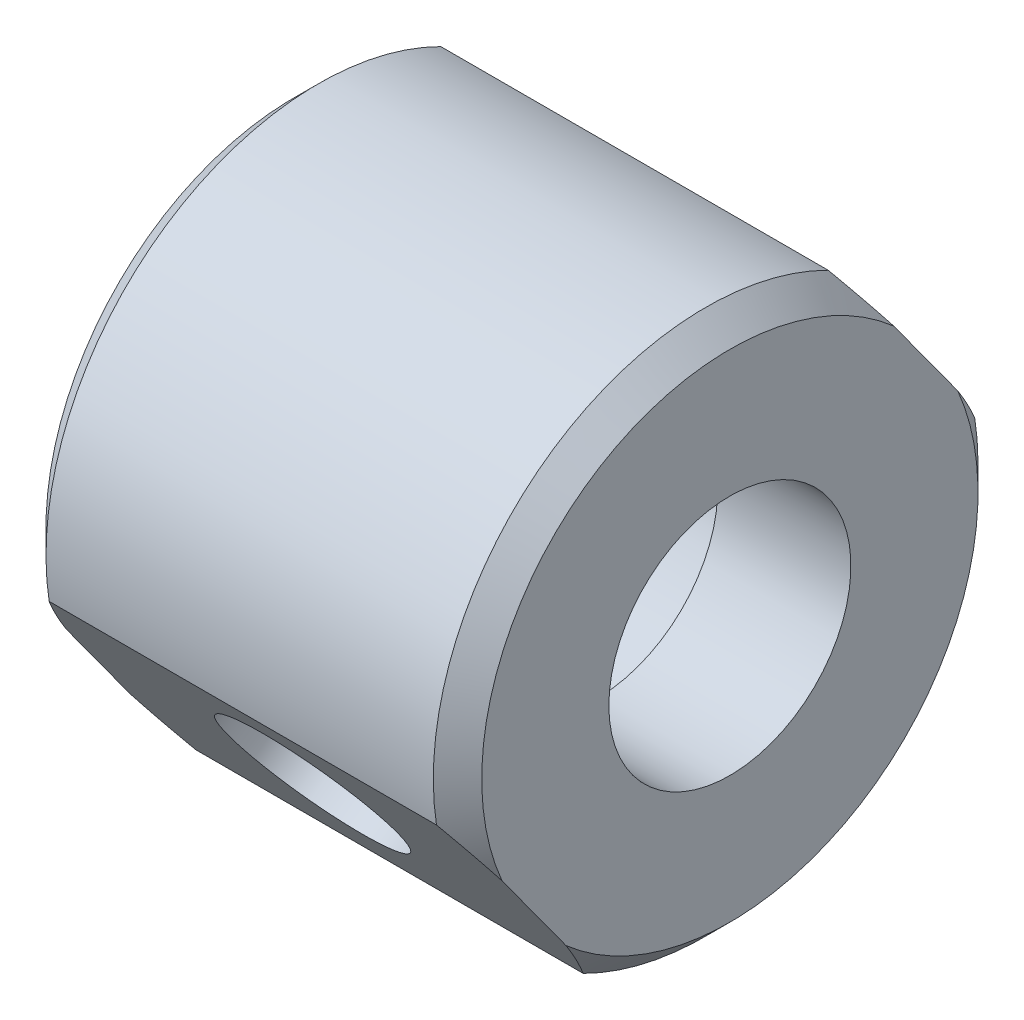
ISO-10303-21;
HEADER;
FILE_DESCRIPTION(('STEP AP214'),'2;1');
FILE_NAME('part.step','',(''),(''),'','','');
FILE_SCHEMA(('AUTOMOTIVE_DESIGN { 1 0 10303 214 1 1 1 1 }'));
ENDSEC;
DATA;
#1=APPLICATION_CONTEXT('core data for automotive mechanical design processes');
#2=APPLICATION_PROTOCOL_DEFINITION('international standard','automotive_design',2000,#1);
#3=PRODUCT_CONTEXT('',#1,'mechanical');
#4=PRODUCT('Part','Part','',(#3));
#5=PRODUCT_RELATED_PRODUCT_CATEGORY('part','',(#4));
#6=PRODUCT_DEFINITION_FORMATION('','',#4);
#7=PRODUCT_DEFINITION_CONTEXT('part definition',#1,'design');
#8=PRODUCT_DEFINITION('design','',#6,#7);
#9=PRODUCT_DEFINITION_SHAPE('','',#8);
#10=(LENGTH_UNIT() NAMED_UNIT(*) SI_UNIT(.MILLI.,.METRE.));
#11=(NAMED_UNIT(*) PLANE_ANGLE_UNIT() SI_UNIT($,.RADIAN.));
#12=(NAMED_UNIT(*) SI_UNIT($,.STERADIAN.) SOLID_ANGLE_UNIT());
#13=UNCERTAINTY_MEASURE_WITH_UNIT(LENGTH_MEASURE(1.E-05),#10,'distance_accuracy_value','');
#14=(GEOMETRIC_REPRESENTATION_CONTEXT(3) GLOBAL_UNCERTAINTY_ASSIGNED_CONTEXT((#13)) GLOBAL_UNIT_ASSIGNED_CONTEXT((#10,
#11,#12)) REPRESENTATION_CONTEXT('',''));
#15=CARTESIAN_POINT('',(0.,0.,0.));
#16=DIRECTION('',(0.,0.,1.));
#17=DIRECTION('',(1.,0.,0.));
#18=AXIS2_PLACEMENT_3D('',#15,#16,#17);
#19=CARTESIAN_POINT('',(-22.125,-21.375,0.));
#20=DIRECTION('',(-1.,0.,0.));
#21=DIRECTION('',(0.,0.,1.));
#22=AXIS2_PLACEMENT_3D('',#19,#20,#21);
#23=CYLINDRICAL_SURFACE('',#22,9.9999999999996);
#24=CARTESIAN_POINT('',(-33.125,-21.375,0.));
#25=DIRECTION('',(-1.,0.,0.));
#26=DIRECTION('',(0.,0.,1.));
#27=AXIS2_PLACEMENT_3D('',#24,#25,#26);
#28=CIRCLE('',#27,9.9999999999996);
#29=CARTESIAN_POINT('',(-33.125,-21.375,9.9999999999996));
#30=VERTEX_POINT('',#29);
#31=EDGE_CURVE('E213',#30,#30,#28,.F.);
#32=ORIENTED_EDGE('',*,*,#31,.F.);
#33=EDGE_LOOP('',(#32));
#34=FACE_BOUND('',#33,.T.);
#35=CARTESIAN_POINT('',(-22.125,-21.375,0.));
#36=DIRECTION('',(-1.,0.,0.));
#37=DIRECTION('',(0.,0.,1.));
#38=AXIS2_PLACEMENT_3D('',#35,#36,#37);
#39=CIRCLE('',#38,9.9999999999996);
#40=CARTESIAN_POINT('',(-22.125,-21.375,9.9999999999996));
#41=VERTEX_POINT('',#40);
#42=EDGE_CURVE('E214',#41,#41,#39,.T.);
#43=ORIENTED_EDGE('',*,*,#42,.F.);
#44=EDGE_LOOP('',(#43));
#45=FACE_BOUND('',#44,.T.);
#46=ADVANCED_FACE('F15',(#34,#45),#23,.F.);
#47=CARTESIAN_POINT('',(-22.125,-21.375,0.));
#48=DIRECTION('',(-1.,0.,0.));
#49=DIRECTION('',(0.,0.,1.));
#50=AXIS2_PLACEMENT_3D('',#47,#48,#49);
#51=CONICAL_SURFACE('',#50,20.5000000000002,0.785398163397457);
#52=CARTESIAN_POINT('',(-22.125,-21.375,0.));
#53=DIRECTION('',(-1.,0.,0.));
#54=DIRECTION('',(0.,0.,1.));
#55=AXIS2_PLACEMENT_3D('',#52,#53,#54);
#56=CIRCLE('',#55,20.5000000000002);
#57=CARTESIAN_POINT('',(-22.125,-36.7712815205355,13.5353062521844));
#58=VERTEX_POINT('',#57);
#59=CARTESIAN_POINT('',(-22.1249999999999,-13.2598714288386,-18.8253735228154));
#60=VERTEX_POINT('',#59);
#61=EDGE_CURVE('E82',#58,#60,#56,.F.);
#62=ORIENTED_EDGE('',*,*,#61,.F.);
#63=CARTESIAN_POINT('',(-22.1250000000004,-36.771281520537,13.5353062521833));
#64=CARTESIAN_POINT('',(-22.1676350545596,-36.9284200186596,13.4211384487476));
#65=CARTESIAN_POINT('',(-22.2127785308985,-37.0851070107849,13.3072986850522));
#66=CARTESIAN_POINT('',(-22.2993269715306,-37.3694720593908,13.1006953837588));
#67=CARTESIAN_POINT('',(-22.3399474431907,-37.497306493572,13.0078182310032));
#68=CARTESIAN_POINT('',(-22.4244049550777,-37.7526230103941,12.8223199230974));
#69=CARTESIAN_POINT('',(-22.468249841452,-37.8801033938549,12.7297000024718));
#70=CARTESIAN_POINT('',(-22.5507874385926,-38.1115046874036,12.5615771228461));
#71=CARTESIAN_POINT('',(-22.5889891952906,-38.2155406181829,12.4859905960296));
#72=CARTESIAN_POINT('',(-22.6862113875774,-38.4731207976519,12.2988476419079));
#73=CARTESIAN_POINT('',(-22.7463975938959,-38.6263781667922,12.1874996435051));
#74=CARTESIAN_POINT('',(-22.8596764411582,-38.9044390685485,11.9854765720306));
#75=CARTESIAN_POINT('',(-22.9121073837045,-39.0294197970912,11.8946727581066));
#76=CARTESIAN_POINT('',(-23.0197350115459,-39.2790023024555,11.7133404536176));
#77=CARTESIAN_POINT('',(-23.0749392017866,-39.4036019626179,11.6228135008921));
#78=CARTESIAN_POINT('',(-23.1777127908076,-39.6297431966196,11.4585122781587));
#79=CARTESIAN_POINT('',(-23.2248727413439,-39.7314069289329,11.3846492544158));
#80=CARTESIAN_POINT('',(-23.3516165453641,-39.9993514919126,11.1899761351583));
#81=CARTESIAN_POINT('',(-23.4325761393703,-40.1652078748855,11.0694744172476));
#82=CARTESIAN_POINT('',(-23.5837437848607,-40.4660355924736,10.8509102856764));
#83=CARTESIAN_POINT('',(-23.6532859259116,-40.6012267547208,10.7526881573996));
#84=CARTESIAN_POINT('',(-23.7952125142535,-40.8711500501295,10.5565774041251));
#85=CARTESIAN_POINT('',(-23.8676054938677,-41.0058792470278,10.4586909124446));
#86=CARTESIAN_POINT('',(-24.0016703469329,-41.2503613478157,10.2810642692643));
#87=CARTESIAN_POINT('',(-24.0629364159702,-41.3602599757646,10.2012182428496));
#88=CARTESIAN_POINT('',(-24.1250000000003,-41.4698613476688,10.1215881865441));
#89=B_SPLINE_CURVE_WITH_KNOTS('',3,(#63,#64,#65,#66,#67,#68,#69,#70,#71,#72,#73,#74,#75,#76,#77,
#78,#79,#80,#81,#82,#83,#84,#85,#86,#87,#88),.UNSPECIFIED.,.F.,.F.,(4,2,2,2,2,2,2,2,2,2,2,2,4),
(0.,0.596545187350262,1.08596165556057,1.57661118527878,1.97904673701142,2.57529637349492,
3.06469283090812,3.55549368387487,3.9581474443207,4.61934458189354,5.16231773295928,
5.70706222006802,6.15410636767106),.UNSPECIFIED.);
#90=CARTESIAN_POINT('',(-24.1250000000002,-41.4698613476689,10.1215881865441));
#91=VERTEX_POINT('',#90);
#92=EDGE_CURVE('E177',#58,#91,#89,.T.);
#93=ORIENTED_EDGE('',*,*,#92,.T.);
#94=CARTESIAN_POINT('',(-24.125,-21.375,0.));
#95=DIRECTION('',(-1.,0.,0.));
#96=DIRECTION('',(0.,0.80901699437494,0.587785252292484));
#97=AXIS2_PLACEMENT_3D('',#94,#95,#96);
#98=CIRCLE('',#97,22.5000000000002);
#99=CARTESIAN_POINT('',(-24.1249999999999,-17.95845125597,-22.2390915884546));
#100=VERTEX_POINT('',#99);
#101=EDGE_CURVE('E85',#91,#100,#98,.F.);
#102=ORIENTED_EDGE('',*,*,#101,.T.);
#103=CARTESIAN_POINT('',(-24.1249999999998,-17.9584512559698,-22.2390915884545));
#104=CARTESIAN_POINT('',(-24.0323377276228,-17.7948121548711,-22.1202008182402));
#105=CARTESIAN_POINT('',(-23.9414532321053,-17.6305132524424,-22.0008306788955));
#106=CARTESIAN_POINT('',(-23.7799510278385,-17.3310662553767,-21.7832697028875));
#107=CARTESIAN_POINT('',(-23.7086926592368,-17.1961440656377,-21.6852429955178));
#108=CARTESIAN_POINT('',(-23.5690945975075,-16.9258532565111,-21.4888652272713));
#109=CARTESIAN_POINT('',(-23.5007457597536,-16.7904877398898,-21.3905164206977));
#110=CARTESIAN_POINT('',(-23.3792021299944,-16.5438891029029,-21.2113520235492));
#111=CARTESIAN_POINT('',(-23.3255361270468,-16.4328065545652,-21.1306458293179));
#112=CARTESIAN_POINT('',(-23.0372838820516,-15.8234181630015,-20.6878992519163));
#113=CARTESIAN_POINT('',(-22.8211887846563,-15.3191764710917,-20.3215462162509));
#114=CARTESIAN_POINT('',(-22.4357816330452,-14.2983657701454,-19.5798838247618));
#115=CARTESIAN_POINT('',(-22.2665409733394,-13.7817792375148,-19.2045617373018));
#116=CARTESIAN_POINT('',(-22.1249999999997,-13.2598714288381,-18.825373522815));
#117=B_SPLINE_CURVE_WITH_KNOTS('',3,(#103,#104,#105,#106,#107,#108,#109,#110,#111,#112,#113,
#114,#115,#116),.UNSPECIFIED.,.F.,.F.,(4,2,2,2,2,2,4),(0.,0.667441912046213,1.2114983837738,
1.75369502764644,2.19595891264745,4.17310336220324,6.1532441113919),.UNSPECIFIED.);
#118=EDGE_CURVE('E79',#100,#60,#117,.T.);
#119=ORIENTED_EDGE('',*,*,#118,.T.);
#120=EDGE_LOOP('',(#62,#93,#102,#119));
#121=FACE_BOUND('',#120,.T.);
#122=ADVANCED_FACE('F81',(#121),#51,.T.);
#123=CARTESIAN_POINT('',(-24.125,-21.375,0.));
#124=DIRECTION('',(-1.,0.,0.));
#125=DIRECTION('',(0.,0.,1.));
#126=AXIS2_PLACEMENT_3D('',#123,#124,#125);
#127=CYLINDRICAL_SURFACE('',#126,22.5000000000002);
#128=DIRECTION('',(-1.,0.,0.));
#129=VECTOR('',#128,1.);
#130=CARTESIAN_POINT('',(-40.125,-41.469861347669,10.121588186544));
#131=LINE('',#130,#129);
#132=CARTESIAN_POINT('',(-56.1249999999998,-41.4698613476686,10.1215881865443));
#133=VERTEX_POINT('',#132);
#134=EDGE_CURVE('E170',#91,#133,#131,.T.);
#135=ORIENTED_EDGE('',*,*,#134,.T.);
#136=CARTESIAN_POINT('',(-56.125,-21.375,0.));
#137=DIRECTION('',(-1.,0.,0.));
#138=DIRECTION('',(0.,0.80901699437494,0.587785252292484));
#139=AXIS2_PLACEMENT_3D('',#136,#137,#138);
#140=CIRCLE('',#139,22.5000000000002);
#141=CARTESIAN_POINT('',(-56.1250000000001,-17.95845125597,-22.2390915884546));
#142=VERTEX_POINT('',#141);
#143=EDGE_CURVE('E219',#133,#142,#140,.F.);
#144=ORIENTED_EDGE('',*,*,#143,.T.);
#145=DIRECTION('',(1.,0.,0.));
#146=VECTOR('',#145,1.);
#147=CARTESIAN_POINT('',(-40.125,-17.9584512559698,-22.2390915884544));
#148=LINE('',#147,#146);
#149=EDGE_CURVE('E91',#142,#100,#148,.T.);
#150=ORIENTED_EDGE('',*,*,#149,.T.);
#151=ORIENTED_EDGE('',*,*,#101,.F.);
#152=EDGE_LOOP('',(#135,#144,#150,#151));
#153=FACE_BOUND('',#152,.T.);
#154=ADVANCED_FACE('F262',(#153),#127,.T.);
#155=CARTESIAN_POINT('',(-22.125,-21.375,0.));
#156=DIRECTION('',(-1.,0.,0.));
#157=DIRECTION('',(0.,0.,1.));
#158=AXIS2_PLACEMENT_3D('',#155,#156,#157);
#159=CONICAL_SURFACE('',#158,20.5000000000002,0.785398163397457);
#160=CARTESIAN_POINT('',(-24.1250000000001,-24.7915487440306,22.2390915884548));
#161=CARTESIAN_POINT('',(-24.0323377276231,-24.9551878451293,22.1202008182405));
#162=CARTESIAN_POINT('',(-23.9414532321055,-25.1194867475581,22.0008306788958));
#163=CARTESIAN_POINT('',(-23.7799510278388,-25.4189337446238,21.7832697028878));
#164=CARTESIAN_POINT('',(-23.7086926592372,-25.5538559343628,21.6852429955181));
#165=CARTESIAN_POINT('',(-23.5690945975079,-25.8241467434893,21.4888652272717));
#166=CARTESIAN_POINT('',(-23.500745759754,-25.9595122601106,21.3905164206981));
#167=CARTESIAN_POINT('',(-23.3792021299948,-26.2061108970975,21.2113520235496));
#168=CARTESIAN_POINT('',(-23.3255361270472,-26.3171934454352,21.1306458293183));
#169=CARTESIAN_POINT('',(-23.0372838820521,-26.9265818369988,20.6878992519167));
#170=CARTESIAN_POINT('',(-22.8211887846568,-27.4308235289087,20.3215462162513));
#171=CARTESIAN_POINT('',(-22.4357816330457,-28.4516342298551,19.5798838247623));
#172=CARTESIAN_POINT('',(-22.2665409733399,-28.9682207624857,19.2045617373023));
#173=CARTESIAN_POINT('',(-22.1250000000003,-29.4901285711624,18.8253735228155));
#174=B_SPLINE_CURVE_WITH_KNOTS('',3,(#160,#161,#162,#163,#164,#165,#166,#167,#168,#169,#170,
#171,#172,#173),.UNSPECIFIED.,.F.,.F.,(4,2,2,2,2,2,4),(0.,0.667441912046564,1.21149838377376,
1.75369502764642,2.1959589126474,4.17310336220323,6.15324411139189),.UNSPECIFIED.);
#175=CARTESIAN_POINT('',(-24.1250000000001,-24.7915487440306,22.2390915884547));
#176=VERTEX_POINT('',#175);
#177=CARTESIAN_POINT('',(-22.1250000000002,-29.490128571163,18.8253735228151));
#178=VERTEX_POINT('',#177);
#179=EDGE_CURVE('E171',#176,#178,#174,.T.);
#180=ORIENTED_EDGE('',*,*,#179,.T.);
#181=CARTESIAN_POINT('',(-22.125,-21.375,0.));
#182=DIRECTION('',(-1.,0.,0.));
#183=DIRECTION('',(0.,0.,1.));
#184=AXIS2_PLACEMENT_3D('',#181,#182,#183);
#185=CIRCLE('',#184,20.5000000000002);
#186=CARTESIAN_POINT('',(-22.125,-5.97871847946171,-13.5353062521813));
#187=VERTEX_POINT('',#186);
#188=EDGE_CURVE('E99',#187,#178,#185,.F.);
#189=ORIENTED_EDGE('',*,*,#188,.F.);
#190=CARTESIAN_POINT('',(-22.1249999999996,-5.97871847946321,-13.5353062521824));
#191=CARTESIAN_POINT('',(-22.1676350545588,-5.82157998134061,-13.4211384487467));
#192=CARTESIAN_POINT('',(-22.2127785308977,-5.66489298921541,-13.3072986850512));
#193=CARTESIAN_POINT('',(-22.2993269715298,-5.38052794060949,-13.1006953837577));
#194=CARTESIAN_POINT('',(-22.3399474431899,-5.25269350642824,-13.0078182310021));
#195=CARTESIAN_POINT('',(-22.424404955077,-4.99737698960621,-12.8223199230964));
#196=CARTESIAN_POINT('',(-22.4682498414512,-4.86989660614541,-12.7297000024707));
#197=CARTESIAN_POINT('',(-22.5507874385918,-4.6384953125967,-12.5615771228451));
#198=CARTESIAN_POINT('',(-22.5889891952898,-4.53445938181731,-12.4859905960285));
#199=CARTESIAN_POINT('',(-22.6862113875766,-4.27687920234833,-12.2988476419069));
#200=CARTESIAN_POINT('',(-22.7463975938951,-4.12362183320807,-12.1874996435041));
#201=CARTESIAN_POINT('',(-22.8596764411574,-3.84556093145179,-11.9854765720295));
#202=CARTESIAN_POINT('',(-22.9121073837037,-3.72058020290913,-11.8946727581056));
#203=CARTESIAN_POINT('',(-23.0197350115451,-3.47099769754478,-11.7133404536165));
#204=CARTESIAN_POINT('',(-23.0749392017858,-3.34639803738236,-11.6228135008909));
#205=CARTESIAN_POINT('',(-23.1777127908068,-3.12025680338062,-11.4585122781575));
#206=CARTESIAN_POINT('',(-23.2248727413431,-3.01859307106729,-11.3846492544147));
#207=CARTESIAN_POINT('',(-23.3516165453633,-2.75064850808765,-11.1899761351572));
#208=CARTESIAN_POINT('',(-23.4325761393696,-2.58479212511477,-11.0694744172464));
#209=CARTESIAN_POINT('',(-23.5837437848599,-2.28396440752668,-10.8509102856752));
#210=CARTESIAN_POINT('',(-23.6532859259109,-2.14877324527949,-10.7526881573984));
#211=CARTESIAN_POINT('',(-23.7952125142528,-1.87884994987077,-10.5565774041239));
#212=CARTESIAN_POINT('',(-23.8676054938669,-1.74412075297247,-10.4586909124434));
#213=CARTESIAN_POINT('',(-24.0016703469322,-1.49963865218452,-10.2810642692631));
#214=CARTESIAN_POINT('',(-24.0629364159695,-1.38974002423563,-10.2012182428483));
#215=CARTESIAN_POINT('',(-24.1249999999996,-1.28013865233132,-10.1215881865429));
#216=B_SPLINE_CURVE_WITH_KNOTS('',3,(#190,#191,#192,#193,#194,#195,#196,#197,#198,#199,#200,
#201,#202,#203,#204,#205,#206,#207,#208,#209,#210,#211,#212,#213,#214,#215),.UNSPECIFIED.,.F.,
.F.,(4,2,2,2,2,2,2,2,2,2,2,2,4),(0.,0.596545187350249,1.08596165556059,1.5766111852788,
1.97904673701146,2.57529637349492,3.06469283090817,3.55549368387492,3.95814744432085,
4.61934458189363,5.16231773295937,5.70706222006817,6.15410636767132),.UNSPECIFIED.);
#217=CARTESIAN_POINT('',(-24.1249999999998,-1.28013865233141,-10.1215881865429));
#218=VERTEX_POINT('',#217);
#219=EDGE_CURVE('E104',#187,#218,#216,.T.);
#220=ORIENTED_EDGE('',*,*,#219,.T.);
#221=CARTESIAN_POINT('',(-24.125,-21.375,0.));
#222=DIRECTION('',(-1.,0.,0.));
#223=DIRECTION('',(0.,0.80901699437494,0.587785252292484));
#224=AXIS2_PLACEMENT_3D('',#221,#222,#223);
#225=CIRCLE('',#224,22.5000000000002);
#226=EDGE_CURVE('E210',#218,#176,#225,.F.);
#227=ORIENTED_EDGE('',*,*,#226,.T.);
#228=EDGE_LOOP('',(#180,#189,#220,#227));
#229=FACE_BOUND('',#228,.T.);
#230=ADVANCED_FACE('F258',(#229),#159,.T.);
#231=CARTESIAN_POINT('',(-22.125,-85.1724931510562,-71.0729515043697));
#232=DIRECTION('',(1.,0.,0.));
#233=DIRECTION('',(0.,0.809016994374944,0.587785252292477));
#234=AXIS2_PLACEMENT_3D('',#231,#232,#233);
#235=PLANE('',#234);
#236=ORIENTED_EDGE('',*,*,#42,.T.);
#237=EDGE_LOOP('',(#236));
#238=FACE_BOUND('',#237,.T.);
#239=DIRECTION('',(0.,0.809016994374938,0.587785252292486));
#240=VECTOR('',#239,1.);
#241=CARTESIAN_POINT('',(-22.125,-15.8424445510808,-20.701722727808));
#242=LINE('',#241,#240);
#243=EDGE_CURVE('E90',#60,#187,#242,.T.);
#244=ORIENTED_EDGE('',*,*,#243,.T.);
#245=ORIENTED_EDGE('',*,*,#188,.T.);
#246=DIRECTION('',(0.,-0.809016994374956,-0.587785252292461));
#247=VECTOR('',#246,1.);
#248=CARTESIAN_POINT('',(-22.125,-26.9075554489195,20.7017227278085));
#249=LINE('',#248,#247);
#250=EDGE_CURVE('E98',#178,#58,#249,.T.);
#251=ORIENTED_EDGE('',*,*,#250,.T.);
#252=ORIENTED_EDGE('',*,*,#61,.T.);
#253=EDGE_LOOP('',(#244,#245,#251,#252));
#254=FACE_BOUND('',#253,.T.);
#255=ADVANCED_FACE('F95',(#238,#254),#235,.T.);
#256=CARTESIAN_POINT('',(-24.125,-21.375,0.));
#257=DIRECTION('',(-1.,0.,0.));
#258=DIRECTION('',(0.,0.,1.));
#259=AXIS2_PLACEMENT_3D('',#256,#257,#258);
#260=CYLINDRICAL_SURFACE('',#259,22.5000000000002);
#261=ORIENTED_EDGE('',*,*,#226,.F.);
#262=DIRECTION('',(-1.,0.,0.));
#263=VECTOR('',#262,1.);
#264=CARTESIAN_POINT('',(-40.125,-1.2801386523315,-10.121588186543));
#265=LINE('',#264,#263);
#266=CARTESIAN_POINT('',(-56.1250000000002,-1.2801386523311,-10.1215881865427));
#267=VERTEX_POINT('',#266);
#268=EDGE_CURVE('E114',#218,#267,#265,.T.);
#269=ORIENTED_EDGE('',*,*,#268,.T.);
#270=CARTESIAN_POINT('',(-56.125,-21.375,0.));
#271=DIRECTION('',(-1.,0.,0.));
#272=DIRECTION('',(0.,0.80901699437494,0.587785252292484));
#273=AXIS2_PLACEMENT_3D('',#270,#271,#272);
#274=CIRCLE('',#273,22.5000000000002);
#275=CARTESIAN_POINT('',(-56.1249999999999,-24.7915487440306,22.2390915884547));
#276=VERTEX_POINT('',#275);
#277=EDGE_CURVE('E196',#267,#276,#274,.F.);
#278=ORIENTED_EDGE('',*,*,#277,.T.);
#279=DIRECTION('',(1.,0.,0.));
#280=VECTOR('',#279,1.);
#281=CARTESIAN_POINT('',(-40.125,-24.7915487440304,22.2390915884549));
#282=LINE('',#281,#280);
#283=EDGE_CURVE('E169',#276,#176,#282,.T.);
#284=ORIENTED_EDGE('',*,*,#283,.T.);
#285=EDGE_LOOP('',(#261,#269,#278,#284));
#286=FACE_BOUND('',#285,.T.);
#287=ADVANCED_FACE('F264',(#286),#260,.T.);
#288=CARTESIAN_POINT('',(-40.125,-32.726196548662,16.474232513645));
#289=DIRECTION('',(0.,0.587785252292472,-0.809016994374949));
#290=DIRECTION('',(0.,0.809016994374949,0.587785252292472));
#291=AXIS2_PLACEMENT_3D('',#288,#289,#290);
#292=CYLINDRICAL_SURFACE('',#291,7.);
#293=CARTESIAN_POINT('',(-33.1848859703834,-27.8271997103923,11.2857927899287));
#294=CARTESIAN_POINT('',(-33.2249233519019,-27.5615982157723,11.4376415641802));
#295=CARTESIAN_POINT('',(-33.2848555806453,-27.2928919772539,11.5787523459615));
#296=CARTESIAN_POINT('',(-33.4430156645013,-26.7526457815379,11.8394208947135));
#297=CARTESIAN_POINT('',(-33.5416422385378,-26.4811059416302,11.958734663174));
#298=CARTESIAN_POINT('',(-33.7754056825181,-25.9408674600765,12.1753272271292));
#299=CARTESIAN_POINT('',(-33.9109567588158,-25.672239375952,12.2723314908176));
#300=CARTESIAN_POINT('',(-34.2162597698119,-25.1439080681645,12.4448138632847));
#301=CARTESIAN_POINT('',(-34.3863512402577,-24.8843260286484,12.5200587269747));
#302=CARTESIAN_POINT('',(-34.7579337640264,-24.3805136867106,12.6504968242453));
#303=CARTESIAN_POINT('',(-34.9596261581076,-24.1363969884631,12.7055533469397));
#304=CARTESIAN_POINT('',(-35.3911436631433,-23.6701732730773,12.7979973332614));
#305=CARTESIAN_POINT('',(-35.6210030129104,-23.448093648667,12.8353630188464));
#306=CARTESIAN_POINT('',(-36.1051503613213,-23.0326488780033,12.8955825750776));
#307=CARTESIAN_POINT('',(-36.3593134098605,-22.8391486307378,12.91850651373));
#308=CARTESIAN_POINT('',(-36.8879504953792,-22.4873354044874,12.9535195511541));
#309=CARTESIAN_POINT('',(-37.1621884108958,-22.3286805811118,12.9657177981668));
#310=CARTESIAN_POINT('',(-37.7264470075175,-22.0524021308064,12.9830696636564));
#311=CARTESIAN_POINT('',(-38.0162077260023,-21.9342583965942,12.9883152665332));
#312=CARTESIAN_POINT('',(-38.6065614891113,-21.743691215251,12.9951200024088));
#313=CARTESIAN_POINT('',(-38.906970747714,-21.6707073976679,12.996725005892));
#314=CARTESIAN_POINT('',(-39.5132940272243,-21.5733988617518,12.9985795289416));
#315=CARTESIAN_POINT('',(-39.8191470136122,-21.5486998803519,12.9988395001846));
#316=CARTESIAN_POINT('',(-40.4308529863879,-21.5486998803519,12.9988395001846));
#317=CARTESIAN_POINT('',(-40.7367059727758,-21.5733988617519,12.9985795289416));
#318=CARTESIAN_POINT('',(-41.3430292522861,-21.6707073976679,12.996725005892));
#319=CARTESIAN_POINT('',(-41.6434385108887,-21.743691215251,12.9951200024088));
#320=CARTESIAN_POINT('',(-42.2337922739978,-21.9342583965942,12.9883152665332));
#321=CARTESIAN_POINT('',(-42.5235529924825,-22.0524021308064,12.9830696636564));
#322=CARTESIAN_POINT('',(-43.0878115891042,-22.3286805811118,12.9657177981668));
#323=CARTESIAN_POINT('',(-43.3620495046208,-22.4873354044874,12.9535195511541));
#324=CARTESIAN_POINT('',(-43.8906865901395,-22.8391486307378,12.91850651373));
#325=CARTESIAN_POINT('',(-44.1448496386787,-23.0326488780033,12.8955825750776));
#326=CARTESIAN_POINT('',(-44.6289969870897,-23.448093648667,12.8353630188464));
#327=CARTESIAN_POINT('',(-44.8588563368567,-23.6701732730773,12.7979973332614));
#328=CARTESIAN_POINT('',(-45.2903738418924,-24.1363969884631,12.7055533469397));
#329=CARTESIAN_POINT('',(-45.4920662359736,-24.3805136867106,12.6504968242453));
#330=CARTESIAN_POINT('',(-45.8636487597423,-24.8843260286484,12.5200587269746));
#331=CARTESIAN_POINT('',(-46.0337402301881,-25.1439080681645,12.4448138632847));
#332=CARTESIAN_POINT('',(-46.3390432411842,-25.6722393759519,12.2723314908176));
#333=CARTESIAN_POINT('',(-46.474594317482,-25.9408674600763,12.1753272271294));
#334=CARTESIAN_POINT('',(-46.7083577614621,-26.4811059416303,11.9587346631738));
#335=CARTESIAN_POINT('',(-46.8069843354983,-26.7526457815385,11.8394208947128));
#336=CARTESIAN_POINT('',(-46.9651444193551,-27.2928919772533,11.5787523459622));
#337=CARTESIAN_POINT('',(-47.0250766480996,-27.56159821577,11.437641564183));
#338=CARTESIAN_POINT('',(-47.10486494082,-28.0909008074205,11.1350305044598));
#339=CARTESIAN_POINT('',(-47.1250046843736,-28.3515414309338,10.9736833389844));
#340=CARTESIAN_POINT('',(-47.1249953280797,-28.8599619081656,10.6333738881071));
#341=CARTESIAN_POINT('',(-47.104964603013,-29.1077773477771,10.4544648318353));
#342=CARTESIAN_POINT('',(-47.0251801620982,-29.5867533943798,10.0826221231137));
#343=CARTESIAN_POINT('',(-46.9653353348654,-29.8178744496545,9.8896572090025));
#344=CARTESIAN_POINT('',(-46.807150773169,-30.2603043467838,9.49420781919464));
#345=CARTESIAN_POINT('',(-46.7085811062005,-30.4714853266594,9.29167295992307));
#346=CARTESIAN_POINT('',(-46.4747746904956,-30.8717519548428,8.88225159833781));
#347=CARTESIAN_POINT('',(-46.3392430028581,-31.0606415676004,8.67534300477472));
#348=CARTESIAN_POINT('',(-46.0338722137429,-31.4148204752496,8.26296130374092));
#349=CARTESIAN_POINT('',(-45.8637622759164,-31.5799046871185,8.05751367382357));
#350=CARTESIAN_POINT('',(-45.4920864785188,-31.8857229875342,7.65435358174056));
#351=CARTESIAN_POINT('',(-45.2903401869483,-32.0263069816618,7.45669417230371));
#352=CARTESIAN_POINT('',(-44.8587082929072,-32.2830832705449,7.07577610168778));
#353=CARTESIAN_POINT('',(-44.6287652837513,-32.3992244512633,6.89254810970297));
#354=CARTESIAN_POINT('',(-44.1444976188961,-32.6076966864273,6.54729793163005));
#355=CARTESIAN_POINT('',(-43.8902350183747,-32.7000862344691,6.38522414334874));
#356=CARTESIAN_POINT('',(-43.3615047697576,-32.8621107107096,6.08889591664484));
#357=CARTESIAN_POINT('',(-43.0871805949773,-32.931890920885,5.95446597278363));
#358=CARTESIAN_POINT('',(-42.5229061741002,-33.0500021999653,5.71939980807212));
#359=CARTESIAN_POINT('',(-42.2331164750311,-33.0985183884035,5.6184738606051));
#360=CARTESIAN_POINT('',(-41.6428692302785,-33.1753770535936,5.45520405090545));
#361=CARTESIAN_POINT('',(-41.3425232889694,-33.2038874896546,5.39253955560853));
#362=CARTESIAN_POINT('',(-40.7364273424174,-33.2416947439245,5.30883335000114));
#363=CARTESIAN_POINT('',(-40.4307136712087,-33.2510909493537,5.28757635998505));
#364=CARTESIAN_POINT('',(-39.8192863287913,-33.2510909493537,5.28757635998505));
#365=CARTESIAN_POINT('',(-39.5135726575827,-33.2416947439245,5.30883335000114));
#366=CARTESIAN_POINT('',(-38.9074767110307,-33.2038874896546,5.39253955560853));
#367=CARTESIAN_POINT('',(-38.6071307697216,-33.1753770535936,5.45520405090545));
#368=CARTESIAN_POINT('',(-38.0168835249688,-33.0985183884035,5.61847386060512));
#369=CARTESIAN_POINT('',(-37.7270938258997,-33.0500021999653,5.71939980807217));
#370=CARTESIAN_POINT('',(-37.1628194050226,-32.931890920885,5.9544659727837));
#371=CARTESIAN_POINT('',(-36.8884952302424,-32.8621107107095,6.08889591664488));
#372=CARTESIAN_POINT('',(-36.3597649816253,-32.7000862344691,6.38522414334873));
#373=CARTESIAN_POINT('',(-36.105502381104,-32.6076966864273,6.54729793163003));
#374=CARTESIAN_POINT('',(-35.6212347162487,-32.3992244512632,6.892548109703));
#375=CARTESIAN_POINT('',(-35.3912917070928,-32.2830832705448,7.07577610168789));
#376=CARTESIAN_POINT('',(-34.9596598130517,-32.0263069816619,7.45669417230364));
#377=CARTESIAN_POINT('',(-34.7579135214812,-31.8857229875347,7.65435358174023));
#378=CARTESIAN_POINT('',(-34.3862377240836,-31.5799046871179,8.05751367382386));
#379=CARTESIAN_POINT('',(-34.2161277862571,-31.4148204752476,8.26296130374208));
#380=CARTESIAN_POINT('',(-33.9107569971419,-31.0606415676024,8.6753430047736));
#381=CARTESIAN_POINT('',(-33.7752253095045,-30.87175195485,8.88225159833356));
#382=CARTESIAN_POINT('',(-33.5414188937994,-30.4714853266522,9.29167295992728));
#383=CARTESIAN_POINT('',(-33.4428492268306,-30.2603043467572,9.49420781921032));
#384=CARTESIAN_POINT('',(-33.284664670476,-29.8178744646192,9.88965719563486));
#385=CARTESIAN_POINT('',(-33.2248198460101,-29.5867534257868,10.0826220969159));
#386=CARTESIAN_POINT('',(-33.145035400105,-29.1077773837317,10.4544648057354));
#387=CARTESIAN_POINT('',(-33.1250046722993,-28.8599619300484,10.6333738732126));
#388=CARTESIAN_POINT('',(-33.1249953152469,-28.3515414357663,10.9736833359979));
#389=CARTESIAN_POINT('',(-33.1451350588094,-28.0909008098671,11.1350305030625));
#390=CARTESIAN_POINT('',(-33.1848859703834,-27.8271997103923,11.2857927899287));
#391=B_SPLINE_CURVE_WITH_KNOTS('',3,(#293,#294,#295,#296,#297,#298,#299,#300,#301,#302,#303,
#304,#305,#306,#307,#308,#309,#310,#311,#312,#313,#314,#315,#316,#317,#318,#319,#320,#321,#322,
#323,#324,#325,#326,#327,#328,#329,#330,#331,#332,#333,#334,#335,#336,#337,#338,#339,#340,#341,
#342,#343,#344,#345,#346,#347,#348,#349,#350,#351,#352,#353,#354,#355,#356,#357,#358,#359,#360,
#361,#362,#363,#364,#365,#366,#367,#368,#369,#370,#371,#372,#373,#374,#375,#376,#377,#378,#379,
#380,#381,#382,#383,#384,#385,#386,#387,#388,#389,#390),.UNSPECIFIED.,.T.,.F.,(4,2,2,2,2,2,2,2,
2,2,2,2,2,2,2,2,2,2,2,2,2,2,2,2,2,2,2,2,2,2,2,2,2,2,2,2,2,2,2,2,2,2,2,2,2,2,2,2,4),(0.,
0.924840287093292,1.8594718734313,2.80505332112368,3.76042386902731,4.72214944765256,
5.68505588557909,6.64325379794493,7.59158399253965,8.52723808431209,9.45103612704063,
10.3676448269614,11.2842535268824,12.2080515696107,13.1437056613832,14.0920358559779,
15.0502337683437,16.0131402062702,16.9748657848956,17.9302363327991,18.8758177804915,
19.8104493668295,20.7352896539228,21.6535126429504,22.5690337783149,23.4866572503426,
24.4098136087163,25.3405634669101,26.27890570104,27.222808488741,28.1686659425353,
29.1121712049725,30.0494876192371,30.9784735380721,31.8995636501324,32.8158520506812,
33.73214045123,34.6532305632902,35.5822164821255,36.5195328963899,37.463038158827,
38.4088956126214,39.3527984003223,40.2911406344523,41.2218904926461,42.1450468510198,
43.0626702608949,43.9781914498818,44.8964144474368),.UNSPECIFIED.);
#392=CARTESIAN_POINT('',(-33.125,-28.6075232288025,10.8053650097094));
#393=VERTEX_POINT('',#392);
#394=EDGE_CURVE('E133',#393,#393,#391,.T.);
#395=ORIENTED_EDGE('',*,*,#394,.F.);
#396=EDGE_LOOP('',(#395));
#397=FACE_BOUND('',#396,.T.);
#398=CARTESIAN_POINT('',(-40.125,-32.726196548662,16.474232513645));
#399=DIRECTION('',(0.,0.587785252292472,-0.809016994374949));
#400=DIRECTION('',(0.,0.809016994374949,0.587785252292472));
#401=AXIS2_PLACEMENT_3D('',#398,#399,#400);
#402=CIRCLE('',#401,7.);
#403=CARTESIAN_POINT('',(-40.125,-27.0630775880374,20.5887292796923));
#404=VERTEX_POINT('',#403);
#405=EDGE_CURVE('E197',#404,#404,#402,.F.);
#406=ORIENTED_EDGE('',*,*,#405,.T.);
#407=EDGE_LOOP('',(#406));
#408=FACE_BOUND('',#407,.T.);
#409=ADVANCED_FACE('F146',(#397,#408),#292,.F.);
#410=CARTESIAN_POINT('',(-33.125,-39.8331975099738,3.28860832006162));
#411=DIRECTION('',(-1.,0.,0.));
#412=DIRECTION('',(0.,0.809016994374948,0.587785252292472));
#413=AXIS2_PLACEMENT_3D('',#410,#411,#412);
#414=PLANE('',#413);
#415=ORIENTED_EDGE('',*,*,#31,.T.);
#416=EDGE_LOOP('',(#415));
#417=FACE_BOUND('',#416,.T.);
#418=CARTESIAN_POINT('',(-33.125,-21.375,0.));
#419=DIRECTION('',(-1.,0.,0.));
#420=DIRECTION('',(0.,0.,1.));
#421=AXIS2_PLACEMENT_3D('',#418,#419,#420);
#422=CIRCLE('',#421,12.9999999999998);
#423=EDGE_CURVE('E132',#393,#393,#422,.F.);
#424=ORIENTED_EDGE('',*,*,#423,.F.);
#425=EDGE_LOOP('',(#424));
#426=FACE_BOUND('',#425,.T.);
#427=ADVANCED_FACE('F144',(#417,#426),#414,.T.);
#428=CARTESIAN_POINT('',(-40.125,-14.7622504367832,-8.25101813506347));
#429=DIRECTION('',(0.,0.587785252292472,-0.809016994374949));
#430=DIRECTION('',(0.,0.809016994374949,0.587785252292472));
#431=AXIS2_PLACEMENT_3D('',#428,#429,#430);
#432=CYLINDRICAL_SURFACE('',#431,7.);
#433=CARTESIAN_POINT('',(-33.184881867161,-14.0723126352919,-10.7550340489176));
#434=CARTESIAN_POINT('',(-33.2248198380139,-14.3234278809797,-10.9255431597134));
#435=CARTESIAN_POINT('',(-33.2846646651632,-14.5783687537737,-11.0857229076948));
#436=CARTESIAN_POINT('',(-33.4428492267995,-15.0911818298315,-11.3842981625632));
#437=CARTESIAN_POINT('',(-33.541418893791,-15.3490624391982,-11.522556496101));
#438=CARTESIAN_POINT('',(-33.7752253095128,-15.8621344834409,-11.776714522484));
#439=CARTESIAN_POINT('',(-33.9107569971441,-16.1172863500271,-11.8924209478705));
#440=CARTESIAN_POINT('',(-34.2161277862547,-16.6189319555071,-12.1018321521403));
#441=CARTESIAN_POINT('',(-34.3862377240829,-16.8653380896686,-12.1953497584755));
#442=CARTESIAN_POINT('',(-34.7579135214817,-17.3432691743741,-12.3616169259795));
#443=CARTESIAN_POINT('',(-34.9596598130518,-17.5746972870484,-12.4342401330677));
#444=CARTESIAN_POINT('',(-35.3912917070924,-18.0163201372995,-12.5607387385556));
#445=CARTESIAN_POINT('',(-35.6212347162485,-18.2264699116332,-12.6145750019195));
#446=CARTESIAN_POINT('',(-36.1055023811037,-18.6192438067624,-12.7061557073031));
#447=CARTESIAN_POINT('',(-36.3597649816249,-18.8019350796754,-12.7439398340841));
#448=CARTESIAN_POINT('',(-36.8884952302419,-19.1338282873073,-12.8064638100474));
#449=CARTESIAN_POINT('',(-37.1628194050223,-19.2832420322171,-12.8312875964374));
#450=CARTESIAN_POINT('',(-37.7270938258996,-19.5433016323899,-12.8709786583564));
#451=CARTESIAN_POINT('',(-38.0168835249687,-19.6542802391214,-12.8859324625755));
#452=CARTESIAN_POINT('',(-38.6071307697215,-19.8333096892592,-12.9085762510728));
#453=CARTESIAN_POINT('',(-38.9074767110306,-19.9017173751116,-12.9163268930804));
#454=CARTESIAN_POINT('',(-39.5135726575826,-19.993009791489,-12.9264170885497));
#455=CARTESIAN_POINT('',(-39.8192863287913,-20.0161299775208,-12.9287846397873));
#456=CARTESIAN_POINT('',(-40.4307136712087,-20.0161299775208,-12.9287846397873));
#457=CARTESIAN_POINT('',(-40.7364273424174,-19.993009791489,-12.9264170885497));
#458=CARTESIAN_POINT('',(-41.3425232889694,-19.9017173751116,-12.9163268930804));
#459=CARTESIAN_POINT('',(-41.6428692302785,-19.8333096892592,-12.9085762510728));
#460=CARTESIAN_POINT('',(-42.2331164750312,-19.6542802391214,-12.8859324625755));
#461=CARTESIAN_POINT('',(-42.5229061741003,-19.5433016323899,-12.8709786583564));
#462=CARTESIAN_POINT('',(-43.0871805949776,-19.2832420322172,-12.8312875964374));
#463=CARTESIAN_POINT('',(-43.361504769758,-19.1338282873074,-12.8064638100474));
#464=CARTESIAN_POINT('',(-43.8902350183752,-18.8019350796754,-12.7439398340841));
#465=CARTESIAN_POINT('',(-44.1444976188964,-18.6192438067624,-12.7061557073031));
#466=CARTESIAN_POINT('',(-44.6287652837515,-18.2264699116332,-12.6145750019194));
#467=CARTESIAN_POINT('',(-44.8587082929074,-18.0163201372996,-12.5607387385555));
#468=CARTESIAN_POINT('',(-45.2903401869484,-17.5746972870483,-12.4342401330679));
#469=CARTESIAN_POINT('',(-45.492086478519,-17.3432691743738,-12.3616169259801));
#470=CARTESIAN_POINT('',(-45.8637622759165,-16.8653380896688,-12.1953497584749));
#471=CARTESIAN_POINT('',(-46.033872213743,-16.6189319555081,-12.1018321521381));
#472=CARTESIAN_POINT('',(-46.3392430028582,-16.1172863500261,-11.8924209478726));
#473=CARTESIAN_POINT('',(-46.4747746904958,-15.8621344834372,-11.776714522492));
#474=CARTESIAN_POINT('',(-46.7085811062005,-15.3490624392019,-11.5225564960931));
#475=CARTESIAN_POINT('',(-46.807150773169,-15.0911818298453,-11.3842981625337));
#476=CARTESIAN_POINT('',(-46.9653353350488,-14.5783687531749,-11.0857229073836));
#477=CARTESIAN_POINT('',(-47.0251801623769,-14.3234278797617,-10.9255431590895));
#478=CARTESIAN_POINT('',(-47.1049646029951,-13.8217727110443,-10.5849155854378));
#479=CARTESIAN_POINT('',(-47.1249953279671,-13.5750409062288,-10.4045150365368));
#480=CARTESIAN_POINT('',(-47.1250046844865,-13.0942768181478,-10.0261398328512));
#481=CARTESIAN_POINT('',(-47.1048649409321,-12.8602841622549,-9.82811488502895));
#482=CARTESIAN_POINT('',(-47.0250766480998,-12.4089204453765,-9.41823016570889));
#483=CARTESIAN_POINT('',(-46.9651444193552,-12.1916813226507,-9.20628097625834));
#484=CARTESIAN_POINT('',(-46.8069843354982,-11.7768255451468,-8.77302732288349));
#485=CARTESIAN_POINT('',(-46.708357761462,-11.5794409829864,-8.5516475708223));
#486=CARTESIAN_POINT('',(-46.4745943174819,-11.2065063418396,-8.10478102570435));
#487=CARTESIAN_POINT('',(-46.3390432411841,-11.0312391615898,-7.8792765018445));
#488=CARTESIAN_POINT('',(-46.033740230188,-10.7039353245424,-7.43010355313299));
#489=CARTESIAN_POINT('',(-45.8636487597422,-10.5521579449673,-7.20647830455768));
#490=CARTESIAN_POINT('',(-45.4920662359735,-10.2724173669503,-6.76763188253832));
#491=CARTESIAN_POINT('',(-45.2903738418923,-10.1446192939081,-6.55247650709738));
#492=CARTESIAN_POINT('',(-44.8588563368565,-9.91262878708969,-6.13763816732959));
#493=CARTESIAN_POINT('',(-44.6289969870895,-9.80846553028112,-5.93797452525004));
#494=CARTESIAN_POINT('',(-44.1448496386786,-9.62281383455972,-5.56147193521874));
#495=CARTESIAN_POINT('',(-43.8906865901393,-9.54121700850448,-5.38452615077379));
#496=CARTESIAN_POINT('',(-43.3620495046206,-9.3992013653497,-5.06075151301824));
#497=CARTESIAN_POINT('',(-43.0878115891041,-9.33857310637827,-4.91363127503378));
#498=CARTESIAN_POINT('',(-42.5235529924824,-9.23669576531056,-4.65623687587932));
#499=CARTESIAN_POINT('',(-42.2337922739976,-9.19519847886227,-4.54549648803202));
#500=CARTESIAN_POINT('',(-41.6434385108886,-9.12983829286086,-4.36635910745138));
#501=CARTESIAN_POINT('',(-41.343029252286,-9.10575860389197,-4.29744334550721));
#502=CARTESIAN_POINT('',(-40.7367059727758,-9.07392485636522,-4.20547050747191));
#503=CARTESIAN_POINT('',(-40.4308529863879,-9.06604520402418,-4.18206071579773));
#504=CARTESIAN_POINT('',(-39.8191470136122,-9.06604520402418,-4.18206071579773));
#505=CARTESIAN_POINT('',(-39.5132940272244,-9.07392485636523,-4.2054705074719));
#506=CARTESIAN_POINT('',(-38.9069707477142,-9.10575860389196,-4.29744334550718));
#507=CARTESIAN_POINT('',(-38.6065614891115,-9.12983829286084,-4.36635910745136));
#508=CARTESIAN_POINT('',(-38.0162077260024,-9.19519847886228,-4.54549648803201));
#509=CARTESIAN_POINT('',(-37.7264470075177,-9.2366957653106,-4.65623687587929));
#510=CARTESIAN_POINT('',(-37.1621884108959,-9.33857310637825,-4.9136312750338));
#511=CARTESIAN_POINT('',(-36.8879504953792,-9.39920136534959,-5.06075151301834));
#512=CARTESIAN_POINT('',(-36.3593134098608,-9.54121700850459,-5.38452615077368));
#513=CARTESIAN_POINT('',(-36.105150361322,-9.62281383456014,-5.56147193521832));
#514=CARTESIAN_POINT('',(-35.6210030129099,-9.8084655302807,-5.93797452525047));
#515=CARTESIAN_POINT('',(-35.3911436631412,-9.91262878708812,-6.13763816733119));
#516=CARTESIAN_POINT('',(-34.9596261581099,-10.1446192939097,-6.55247650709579));
#517=CARTESIAN_POINT('',(-34.7579337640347,-10.2724173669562,-6.76763188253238));
#518=CARTESIAN_POINT('',(-34.3863512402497,-10.5521579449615,-7.20647830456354));
#519=CARTESIAN_POINT('',(-34.2162597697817,-10.7039353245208,-7.43010355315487));
#520=CARTESIAN_POINT('',(-33.9109567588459,-11.0312391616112,-7.87927650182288));
#521=CARTESIAN_POINT('',(-33.7754056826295,-11.206506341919,-8.10478102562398));
#522=CARTESIAN_POINT('',(-33.5416422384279,-11.5794409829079,-8.55164757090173));
#523=CARTESIAN_POINT('',(-33.4430156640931,-11.7768255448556,-8.77302732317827));
#524=CARTESIAN_POINT('',(-33.2848555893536,-12.1916813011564,-9.20628095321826));
#525=CARTESIAN_POINT('',(-33.2249233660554,-12.4089204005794,-9.41823011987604));
#526=CARTESIAN_POINT('',(-33.1451350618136,-12.8602841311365,-9.82811485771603));
#527=CARTESIAN_POINT('',(-33.1249953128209,-13.0942768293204,-10.0261398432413));
#528=CARTESIAN_POINT('',(-33.1250046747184,-13.5750409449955,-10.4045150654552));
#529=CARTESIAN_POINT('',(-33.1450354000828,-13.8217727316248,-10.584915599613));
#530=CARTESIAN_POINT('',(-33.184881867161,-14.0723126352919,-10.7550340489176));
#531=B_SPLINE_CURVE_WITH_KNOTS('',3,(#433,#434,#435,#436,#437,#438,#439,#440,#441,#442,#443,
#444,#445,#446,#447,#448,#449,#450,#451,#452,#453,#454,#455,#456,#457,#458,#459,#460,#461,#462,
#463,#464,#465,#466,#467,#468,#469,#470,#471,#472,#473,#474,#475,#476,#477,#478,#479,#480,#481,
#482,#483,#484,#485,#486,#487,#488,#489,#490,#491,#492,#493,#494,#495,#496,#497,#498,#499,#500,
#501,#502,#503,#504,#505,#506,#507,#508,#509,#510,#511,#512,#513,#514,#515,#516,#517,#518,#519,
#520,#521,#522,#523,#524,#525,#526,#527,#528,#529,#530),.UNSPECIFIED.,.T.,.F.,(4,2,2,2,2,2,2,2,
2,2,2,2,2,2,2,2,2,2,2,2,2,2,2,2,2,2,2,2,2,2,2,2,2,2,2,2,2,2,2,2,2,2,2,2,2,2,2,2,4),(0.,
0.917623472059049,1.84077983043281,2.77152968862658,3.7098719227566,4.65377471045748,
5.59963216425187,6.54313742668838,7.48045384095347,8.40943975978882,9.33052987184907,
10.2468182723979,11.1631066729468,12.084196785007,13.0131827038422,13.9504991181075,
14.894004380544,15.8398618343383,16.7837646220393,17.7221068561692,18.6528567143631,
19.5760130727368,20.493636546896,21.4091576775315,22.3273806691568,23.2522209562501,
24.1868525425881,25.1324339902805,26.087804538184,27.0495301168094,28.0124365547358,
28.9706344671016,29.9189646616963,30.8546187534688,31.778416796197,32.6950254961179,
33.6116341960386,34.5354322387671,35.4710863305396,36.4194165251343,37.3776144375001,
38.3405208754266,39.3022464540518,40.2576170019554,41.2031984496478,42.1378300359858,
43.0626702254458,43.9808933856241,44.8964144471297),.UNSPECIFIED.);
#532=CARTESIAN_POINT('',(-33.184881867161,-14.0723126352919,-10.7550340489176));
#533=VERTEX_POINT('',#532);
#534=EDGE_CURVE('E125',#533,#533,#531,.T.);
#535=ORIENTED_EDGE('',*,*,#534,.F.);
#536=EDGE_LOOP('',(#535));
#537=FACE_BOUND('',#536,.T.);
#538=CARTESIAN_POINT('',(-40.125,-9.2147864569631,-15.886447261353));
#539=DIRECTION('',(0.,0.587785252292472,-0.809016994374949));
#540=DIRECTION('',(0.,0.809016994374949,0.587785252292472));
#541=AXIS2_PLACEMENT_3D('',#538,#539,#540);
#542=CIRCLE('',#541,7.);
#543=CARTESIAN_POINT('',(-40.125,-3.55166749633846,-11.7719504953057));
#544=VERTEX_POINT('',#543);
#545=EDGE_CURVE('E106',#544,#544,#542,.T.);
#546=ORIENTED_EDGE('',*,*,#545,.T.);
#547=EDGE_LOOP('',(#546));
#548=FACE_BOUND('',#547,.T.);
#549=ADVANCED_FACE('F139',(#537,#548),#432,.F.);
#550=CARTESIAN_POINT('',(-22.125,-1.2801386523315,-10.121588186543));
#551=DIRECTION('',(0.,-0.587785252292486,0.809016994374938));
#552=DIRECTION('',(-1.,0.,0.));
#553=AXIS2_PLACEMENT_3D('',#550,#551,#552);
#554=PLANE('',#553);
#555=ORIENTED_EDGE('',*,*,#545,.F.);
#556=EDGE_LOOP('',(#555));
#557=FACE_BOUND('',#556,.T.);
#558=ORIENTED_EDGE('',*,*,#118,.F.);
#559=ORIENTED_EDGE('',*,*,#149,.F.);
#560=CARTESIAN_POINT('',(-56.1250000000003,-17.9584512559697,-22.2390915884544));
#561=CARTESIAN_POINT('',(-56.1870634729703,-17.8488500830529,-22.1594616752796));
#562=CARTESIAN_POINT('',(-56.2483294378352,-17.7389516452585,-22.0796157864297));
#563=CARTESIAN_POINT('',(-56.3823942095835,-17.4944697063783,-21.9019892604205));
#564=CARTESIAN_POINT('',(-56.454787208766,-17.3597404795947,-21.8041027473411));
#565=CARTESIAN_POINT('',(-56.5967138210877,-17.0898171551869,-21.6079919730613));
#566=CARTESIAN_POINT('',(-56.6662559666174,-16.9546259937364,-21.5097698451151));
#567=CARTESIAN_POINT('',(-56.8174236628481,-16.6537981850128,-21.2912056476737));
#568=CARTESIAN_POINT('',(-56.8983833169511,-16.4879416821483,-21.1707038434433));
#569=CARTESIAN_POINT('',(-57.0205661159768,-16.2296393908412,-20.9830362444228));
#570=CARTESIAN_POINT('',(-57.0633119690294,-16.1376631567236,-20.9162115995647));
#571=CARTESIAN_POINT('',(-57.1566484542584,-15.9330902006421,-20.7675806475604));
#572=CARTESIAN_POINT('',(-57.2069045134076,-15.8203932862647,-20.685701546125));
#573=CARTESIAN_POINT('',(-57.305153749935,-15.5946862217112,-20.5217157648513));
#574=CARTESIAN_POINT('',(-57.3531524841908,-15.4816776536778,-20.439610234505));
#575=CARTESIAN_POINT('',(-57.4571913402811,-15.2302807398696,-20.2569596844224));
#576=CARTESIAN_POINT('',(-57.5126946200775,-15.0917464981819,-20.1563086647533));
#577=CARTESIAN_POINT('',(-57.6103625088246,-14.8393494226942,-19.9729314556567));
#578=CARTESIAN_POINT('',(-57.6531036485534,-14.7256323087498,-19.8903111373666));
#579=CARTESIAN_POINT('',(-57.7452892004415,-14.4726727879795,-19.7065252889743));
#580=CARTESIAN_POINT('',(-57.7941531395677,-14.3332914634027,-19.6052588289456));
#581=CARTESIAN_POINT('',(-57.8880346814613,-14.0540970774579,-19.4024122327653));
#582=CARTESIAN_POINT('',(-57.9330625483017,-13.9142862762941,-19.300833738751));
#583=CARTESIAN_POINT('',(-58.0286845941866,-13.603246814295,-19.0748503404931));
#584=CARTESIAN_POINT('',(-58.0783444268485,-13.4318300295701,-18.9503087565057));
#585=CARTESIAN_POINT('',(-58.1250000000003,-13.259871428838,-18.825373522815));
#586=B_SPLINE_CURVE_WITH_KNOTS('',3,(#560,#561,#562,#563,#564,#565,#566,#567,#568,#569,#570,
#571,#572,#573,#574,#575,#576,#577,#578,#579,#580,#581,#582,#583,#584,#585),.UNSPECIFIED.,.F.,
.F.,(4,2,2,2,2,2,2,2,2,2,2,2,4),(0.,0.447043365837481,0.991787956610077,1.5347612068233,
2.1959583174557,2.5603293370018,3.00457946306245,3.44767162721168,3.98765877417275,
4.42839011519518,4.96558958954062,5.50130332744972,6.15410292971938),.UNSPECIFIED.);
#587=CARTESIAN_POINT('',(-58.1250000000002,-13.2598714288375,-18.825373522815));
#588=VERTEX_POINT('',#587);
#589=EDGE_CURVE('E109',#142,#588,#586,.T.);
#590=ORIENTED_EDGE('',*,*,#589,.T.);
#591=DIRECTION('',(0.,-0.809016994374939,-0.587785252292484));
#592=VECTOR('',#591,1.);
#593=CARTESIAN_POINT('',(-58.125,-39.1034698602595,-37.6018468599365));
#594=LINE('',#593,#592);
#595=CARTESIAN_POINT('',(-58.1250000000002,-5.97871847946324,-13.5353062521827));
#596=VERTEX_POINT('',#595);
#597=EDGE_CURVE('E123',#596,#588,#594,.T.);
#598=ORIENTED_EDGE('',*,*,#597,.F.);
#599=CARTESIAN_POINT('',(-56.1250000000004,-1.28013865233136,-10.1215881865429));
#600=CARTESIAN_POINT('',(-56.217661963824,-1.44377696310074,-10.2404783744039));
#601=CARTESIAN_POINT('',(-56.3085466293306,-1.60807630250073,-10.359848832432));
#602=CARTESIAN_POINT('',(-56.4700490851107,-1.90752394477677,-10.5774102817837));
#603=CARTESIAN_POINT('',(-56.5413075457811,-2.04244637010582,-10.6754371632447));
#604=CARTESIAN_POINT('',(-56.6809051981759,-2.31273612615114,-10.871814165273));
#605=CARTESIAN_POINT('',(-56.7492535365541,-2.44810035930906,-10.9701620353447));
#606=CARTESIAN_POINT('',(-56.8707983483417,-2.6947020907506,-11.1493286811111));
#607=CARTESIAN_POINT('',(-56.9244656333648,-2.80578798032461,-11.2300373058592));
#608=CARTESIAN_POINT('',(-57.056398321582,-3.08470201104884,-11.432680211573));
#609=CARTESIAN_POINT('',(-57.1334305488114,-3.25291387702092,-11.5548932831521));
#610=CARTESIAN_POINT('',(-57.2689713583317,-3.55948152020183,-11.7776277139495));
#611=CARTESIAN_POINT('',(-57.328271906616,-3.69760855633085,-11.8779828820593));
#612=CARTESIAN_POINT('',(-57.4433799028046,-3.97429969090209,-12.0790107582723));
#613=CARTESIAN_POINT('',(-57.4991983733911,-4.11286078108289,-12.1796812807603));
#614=CARTESIAN_POINT('',(-57.5974263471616,-4.36525720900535,-12.363058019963));
#615=CARTESIAN_POINT('',(-57.6404119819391,-4.47894607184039,-12.4456578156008));
#616=CARTESIAN_POINT('',(-57.7331270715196,-4.73178619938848,-12.6293569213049));
#617=CARTESIAN_POINT('',(-57.7822794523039,-4.87107651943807,-12.7305572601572));
#618=CARTESIAN_POINT('',(-57.868177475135,-5.1247671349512,-12.9148742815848));
#619=CARTESIAN_POINT('',(-57.9055416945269,-5.23903064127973,-12.9978915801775));
#620=CARTESIAN_POINT('',(-57.9776318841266,-5.46781132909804,-13.164110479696));
#621=CARTESIAN_POINT('',(-58.0123639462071,-5.58232725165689,-13.2473111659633));
#622=CARTESIAN_POINT('',(-58.0730718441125,-5.79080389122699,-13.3987783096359));
#623=CARTESIAN_POINT('',(-58.0994851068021,-5.88468137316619,-13.466984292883));
#624=CARTESIAN_POINT('',(-58.1250000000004,-5.97871847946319,-13.5353062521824));
#625=B_SPLINE_CURVE_WITH_KNOTS('',3,(#599,#600,#601,#602,#603,#604,#605,#606,#607,#608,#609,
#610,#611,#612,#613,#614,#615,#616,#617,#618,#619,#620,#621,#622,#623,#624),.UNSPECIFIED.,.F.,
.F.,(4,2,2,2,2,2,2,2,2,2,2,2,4),(0.,0.667441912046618,1.21149838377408,1.75369502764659,
2.19595813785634,2.86109604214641,3.40328485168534,3.94365972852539,4.3845051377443,
4.9216154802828,5.35988243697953,5.79710195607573,6.1541098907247),.UNSPECIFIED.);
#626=EDGE_CURVE('E116',#267,#596,#625,.T.);
#627=ORIENTED_EDGE('',*,*,#626,.F.);
#628=ORIENTED_EDGE('',*,*,#268,.F.);
#629=ORIENTED_EDGE('',*,*,#219,.F.);
#630=ORIENTED_EDGE('',*,*,#243,.F.);
#631=EDGE_LOOP('',(#558,#559,#590,#598,#627,#628,#629,#630));
#632=FACE_BOUND('',#631,.T.);
#633=ADVANCED_FACE('F101',(#557,#632),#554,.F.);
#634=CARTESIAN_POINT('',(-56.125,-21.375,0.));
#635=DIRECTION('',(1.,0.,0.));
#636=DIRECTION('',(0.,0.,-1.));
#637=AXIS2_PLACEMENT_3D('',#634,#635,#636);
#638=CONICAL_SURFACE('',#637,22.5000000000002,0.785398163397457);
#639=ORIENTED_EDGE('',*,*,#143,.F.);
#640=CARTESIAN_POINT('',(-56.1249999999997,-41.4698613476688,10.1215881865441));
#641=CARTESIAN_POINT('',(-56.2176619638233,-41.3062230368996,10.2404783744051));
#642=CARTESIAN_POINT('',(-56.3085466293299,-41.1419236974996,10.3598488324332));
#643=CARTESIAN_POINT('',(-56.47004908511,-40.8424760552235,10.5774102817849));
#644=CARTESIAN_POINT('',(-56.5413075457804,-40.7075536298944,10.6754371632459));
#645=CARTESIAN_POINT('',(-56.6809051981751,-40.4372638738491,10.8718141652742));
#646=CARTESIAN_POINT('',(-56.7492535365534,-40.3018996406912,10.9701620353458));
#647=CARTESIAN_POINT('',(-56.870798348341,-40.0552979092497,11.1493286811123));
#648=CARTESIAN_POINT('',(-56.924465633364,-39.9442120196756,11.2300373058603));
#649=CARTESIAN_POINT('',(-57.0563983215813,-39.6652979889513,11.4326802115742));
#650=CARTESIAN_POINT('',(-57.1334305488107,-39.4970861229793,11.5548932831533));
#651=CARTESIAN_POINT('',(-57.2689713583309,-39.1905184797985,11.7776277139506));
#652=CARTESIAN_POINT('',(-57.3282719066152,-39.0523914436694,11.8779828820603));
#653=CARTESIAN_POINT('',(-57.4433799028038,-38.7757003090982,12.0790107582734));
#654=CARTESIAN_POINT('',(-57.4991983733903,-38.6371392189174,12.1796812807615));
#655=CARTESIAN_POINT('',(-57.5974263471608,-38.3847427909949,12.3630580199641));
#656=CARTESIAN_POINT('',(-57.6404119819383,-38.2710539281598,12.4456578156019));
#657=CARTESIAN_POINT('',(-57.7331270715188,-38.0182138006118,12.629356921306));
#658=CARTESIAN_POINT('',(-57.7822794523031,-37.8789234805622,12.7305572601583));
#659=CARTESIAN_POINT('',(-57.8681774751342,-37.6252328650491,12.9148742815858));
#660=CARTESIAN_POINT('',(-57.9055416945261,-37.5109693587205,12.9978915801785));
#661=CARTESIAN_POINT('',(-57.9776318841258,-37.2821886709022,13.164110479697));
#662=CARTESIAN_POINT('',(-58.0123639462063,-37.1676727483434,13.2473111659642));
#663=CARTESIAN_POINT('',(-58.0730718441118,-36.9591961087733,13.3987783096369));
#664=CARTESIAN_POINT('',(-58.0994851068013,-36.865318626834,13.466984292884));
#665=CARTESIAN_POINT('',(-58.1249999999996,-36.771281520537,13.5353062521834));
#666=B_SPLINE_CURVE_WITH_KNOTS('',3,(#640,#641,#642,#643,#644,#645,#646,#647,#648,#649,#650,
#651,#652,#653,#654,#655,#656,#657,#658,#659,#660,#661,#662,#663,#664,#665),.UNSPECIFIED.,.F.,
.F.,(4,2,2,2,2,2,2,2,2,2,2,2,4),(0.,0.667441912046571,1.21149838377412,1.75369502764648,
2.19595813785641,2.8610960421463,3.40328485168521,3.94365972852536,4.38450513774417,
4.92161548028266,5.35988243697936,5.79710195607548,6.15410989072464),.UNSPECIFIED.);
#667=CARTESIAN_POINT('',(-58.1249999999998,-36.7712815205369,13.5353062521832));
#668=VERTEX_POINT('',#667);
#669=EDGE_CURVE('E164',#133,#668,#666,.T.);
#670=ORIENTED_EDGE('',*,*,#669,.T.);
#671=CARTESIAN_POINT('',(-58.125,-21.375,0.));
#672=DIRECTION('',(1.,0.,0.));
#673=DIRECTION('',(0.,0.,-1.));
#674=AXIS2_PLACEMENT_3D('',#671,#672,#673);
#675=CIRCLE('',#674,20.5000000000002);
#676=EDGE_CURVE('E120',#588,#668,#675,.F.);
#677=ORIENTED_EDGE('',*,*,#676,.F.);
#678=ORIENTED_EDGE('',*,*,#589,.F.);
#679=EDGE_LOOP('',(#639,#670,#677,#678));
#680=FACE_BOUND('',#679,.T.);
#681=ADVANCED_FACE('F149',(#680),#638,.T.);
#682=CARTESIAN_POINT('',(-22.125,-41.469861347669,10.121588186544));
#683=DIRECTION('',(0.,0.587785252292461,-0.809016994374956));
#684=DIRECTION('',(-1.,0.,0.));
#685=AXIS2_PLACEMENT_3D('',#682,#683,#684);
#686=PLANE('',#685);
#687=ORIENTED_EDGE('',*,*,#405,.F.);
#688=EDGE_LOOP('',(#687));
#689=FACE_BOUND('',#688,.T.);
#690=ORIENTED_EDGE('',*,*,#179,.F.);
#691=ORIENTED_EDGE('',*,*,#283,.F.);
#692=CARTESIAN_POINT('',(-56.1249999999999,-24.7915487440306,22.2390915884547));
#693=CARTESIAN_POINT('',(-56.1870634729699,-24.9011499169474,22.1594616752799));
#694=CARTESIAN_POINT('',(-56.2483294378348,-25.0110483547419,22.07961578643));
#695=CARTESIAN_POINT('',(-56.3823942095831,-25.2555302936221,21.9019892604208));
#696=CARTESIAN_POINT('',(-56.4547872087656,-25.3902595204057,21.8041027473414));
#697=CARTESIAN_POINT('',(-56.5967138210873,-25.6601828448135,21.6079919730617));
#698=CARTESIAN_POINT('',(-56.666255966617,-25.795374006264,21.5097698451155));
#699=CARTESIAN_POINT('',(-56.8174236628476,-26.0962018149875,21.291205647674));
#700=CARTESIAN_POINT('',(-56.8983833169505,-26.2620583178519,21.1707038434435));
#701=CARTESIAN_POINT('',(-57.0205661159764,-26.5203606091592,20.9830362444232));
#702=CARTESIAN_POINT('',(-57.063311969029,-26.6123368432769,20.9162115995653));
#703=CARTESIAN_POINT('',(-57.1566484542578,-26.816909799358,20.7675806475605));
#704=CARTESIAN_POINT('',(-57.2069045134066,-26.929606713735,20.6857015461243));
#705=CARTESIAN_POINT('',(-57.3051537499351,-27.1553137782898,20.5217157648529));
#706=CARTESIAN_POINT('',(-57.3531524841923,-27.268322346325,20.4396102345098));
#707=CARTESIAN_POINT('',(-57.4571913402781,-27.5197192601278,20.2569596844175));
#708=CARTESIAN_POINT('',(-57.5126946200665,-27.6582535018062,20.1563086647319));
#709=CARTESIAN_POINT('',(-57.6103625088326,-27.9106505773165,19.9729314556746));
#710=CARTESIAN_POINT('',(-57.6531036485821,-28.0243676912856,19.8903111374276));
#711=CARTESIAN_POINT('',(-57.7452892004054,-28.2773272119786,19.7065252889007));
#712=CARTESIAN_POINT('',(-57.7941531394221,-28.4167085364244,19.6052588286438));
#713=CARTESIAN_POINT('',(-57.8880346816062,-28.6959029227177,19.4024122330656));
#714=CARTESIAN_POINT('',(-57.9330625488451,-28.8357137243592,19.3008337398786));
#715=CARTESIAN_POINT('',(-58.0286845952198,-29.146753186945,19.0748503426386));
#716=CARTESIAN_POINT('',(-58.0783444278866,-29.3181699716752,18.950308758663));
#717=CARTESIAN_POINT('',(-58.1249999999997,-29.4901285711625,18.8253735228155));
#718=B_SPLINE_CURVE_WITH_KNOTS('',3,(#692,#693,#694,#695,#696,#697,#698,#699,#700,#701,#702,
#703,#704,#705,#706,#707,#708,#709,#710,#711,#712,#713,#714,#715,#716,#717),.UNSPECIFIED.,.F.,
.F.,(4,2,2,2,2,2,2,2,2,2,2,2,4),(0.,0.44704336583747,0.991787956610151,1.53476120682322,
2.19595831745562,2.56032933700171,3.00457946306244,3.44767162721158,3.98765877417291,
4.42839011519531,4.9655895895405,5.50130332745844,6.15410292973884),.UNSPECIFIED.);
#719=CARTESIAN_POINT('',(-58.1249999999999,-29.4901285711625,18.8253735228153));
#720=VERTEX_POINT('',#719);
#721=EDGE_CURVE('E191',#276,#720,#718,.T.);
#722=ORIENTED_EDGE('',*,*,#721,.T.);
#723=DIRECTION('',(0.,0.809016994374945,0.587785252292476));
#724=VECTOR('',#723,1.);
#725=CARTESIAN_POINT('',(-58.125,-62.6148799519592,-5.24116708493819));
#726=LINE('',#725,#724);
#727=EDGE_CURVE('E25',#668,#720,#726,.T.);
#728=ORIENTED_EDGE('',*,*,#727,.F.);
#729=ORIENTED_EDGE('',*,*,#669,.F.);
#730=ORIENTED_EDGE('',*,*,#134,.F.);
#731=ORIENTED_EDGE('',*,*,#92,.F.);
#732=ORIENTED_EDGE('',*,*,#250,.F.);
#733=EDGE_LOOP('',(#690,#691,#722,#728,#729,#730,#731,#732));
#734=FACE_BOUND('',#733,.T.);
#735=ADVANCED_FACE('F152',(#689,#734),#686,.F.);
#736=CARTESIAN_POINT('',(-56.125,-21.375,0.));
#737=DIRECTION('',(1.,0.,0.));
#738=DIRECTION('',(0.,0.,-1.));
#739=AXIS2_PLACEMENT_3D('',#736,#737,#738);
#740=CONICAL_SURFACE('',#739,22.5000000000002,0.785398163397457);
#741=ORIENTED_EDGE('',*,*,#277,.F.);
#742=ORIENTED_EDGE('',*,*,#626,.T.);
#743=CARTESIAN_POINT('',(-58.125,-21.375,0.));
#744=DIRECTION('',(1.,0.,0.));
#745=DIRECTION('',(0.,0.,-1.));
#746=AXIS2_PLACEMENT_3D('',#743,#744,#745);
#747=CIRCLE('',#746,20.5000000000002);
#748=EDGE_CURVE('E34',#720,#596,#747,.F.);
#749=ORIENTED_EDGE('',*,*,#748,.F.);
#750=ORIENTED_EDGE('',*,*,#721,.F.);
#751=EDGE_LOOP('',(#741,#742,#749,#750));
#752=FACE_BOUND('',#751,.T.);
#753=ADVANCED_FACE('F154',(#752),#740,.T.);
#754=CARTESIAN_POINT('',(-33.125,-21.375,0.));
#755=DIRECTION('',(-1.,0.,0.));
#756=DIRECTION('',(0.,0.,1.));
#757=AXIS2_PLACEMENT_3D('',#754,#755,#756);
#758=CYLINDRICAL_SURFACE('',#757,12.9999999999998);
#759=CARTESIAN_POINT('',(-58.125,-21.375,0.));
#760=DIRECTION('',(-1.,0.,0.));
#761=DIRECTION('',(0.,0.,1.));
#762=AXIS2_PLACEMENT_3D('',#759,#760,#761);
#763=CIRCLE('',#762,12.9999999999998);
#764=CARTESIAN_POINT('',(-58.125,-21.375,12.9999999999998));
#765=VERTEX_POINT('',#764);
#766=EDGE_CURVE('E10',#765,#765,#763,.F.);
#767=ORIENTED_EDGE('',*,*,#766,.F.);
#768=EDGE_LOOP('',(#767));
#769=FACE_BOUND('',#768,.T.);
#770=ORIENTED_EDGE('',*,*,#534,.T.);
#771=EDGE_LOOP('',(#770));
#772=FACE_BOUND('',#771,.T.);
#773=ORIENTED_EDGE('',*,*,#394,.T.);
#774=ORIENTED_EDGE('',*,*,#423,.T.);
#775=EDGE_LOOP('',(#773,#774));
#776=FACE_BOUND('',#775,.T.);
#777=ADVANCED_FACE('F135',(#769,#772,#776),#758,.F.);
#778=CARTESIAN_POINT('',(-58.125,-108.683903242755,-38.7122717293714));
#779=DIRECTION('',(-1.,0.,0.));
#780=DIRECTION('',(0.,0.809016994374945,0.587785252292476));
#781=AXIS2_PLACEMENT_3D('',#778,#779,#780);
#782=PLANE('',#781);
#783=ORIENTED_EDGE('',*,*,#766,.T.);
#784=EDGE_LOOP('',(#783));
#785=FACE_BOUND('',#784,.T.);
#786=ORIENTED_EDGE('',*,*,#727,.T.);
#787=ORIENTED_EDGE('',*,*,#748,.T.);
#788=ORIENTED_EDGE('',*,*,#597,.T.);
#789=ORIENTED_EDGE('',*,*,#676,.T.);
#790=EDGE_LOOP('',(#786,#787,#788,#789));
#791=FACE_BOUND('',#790,.T.);
#792=ADVANCED_FACE('F17',(#785,#791),#782,.T.);
#793=CLOSED_SHELL('',(#46,#122,#154,#230,#255,#287,#409,#427,#549,#633,#681,#735,#753,#777,#792));
#794=MANIFOLD_SOLID_BREP('B1',#793);
#795=ADVANCED_BREP_SHAPE_REPRESENTATION('',(#18,#794),#14);
#796=SHAPE_DEFINITION_REPRESENTATION(#9,#795);
ENDSEC;
END-ISO-10303-21;
